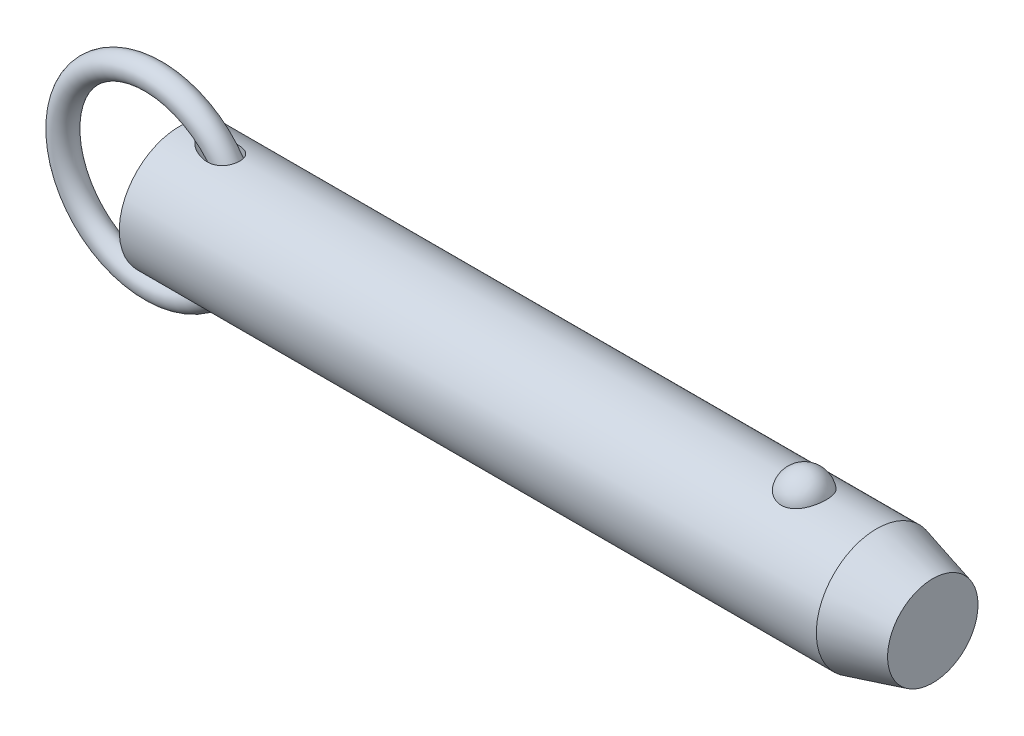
ISO-10303-21;
HEADER;
FILE_DESCRIPTION(('STEP AP214'),'2;1');
FILE_NAME('part.step','',(''),(''),'','','');
FILE_SCHEMA(('AUTOMOTIVE_DESIGN { 1 0 10303 214 1 1 1 1 }'));
ENDSEC;
DATA;
#1=APPLICATION_CONTEXT('core data for automotive mechanical design processes');
#2=APPLICATION_PROTOCOL_DEFINITION('international standard','automotive_design',2000,#1);
#3=PRODUCT_CONTEXT('',#1,'mechanical');
#4=PRODUCT('Part','Part','',(#3));
#5=PRODUCT_RELATED_PRODUCT_CATEGORY('part','',(#4));
#6=PRODUCT_DEFINITION_FORMATION('','',#4);
#7=PRODUCT_DEFINITION_CONTEXT('part definition',#1,'design');
#8=PRODUCT_DEFINITION('design','',#6,#7);
#9=PRODUCT_DEFINITION_SHAPE('','',#8);
#10=(LENGTH_UNIT() NAMED_UNIT(*) SI_UNIT(.MILLI.,.METRE.));
#11=(NAMED_UNIT(*) PLANE_ANGLE_UNIT() SI_UNIT($,.RADIAN.));
#12=(NAMED_UNIT(*) SI_UNIT($,.STERADIAN.) SOLID_ANGLE_UNIT());
#13=UNCERTAINTY_MEASURE_WITH_UNIT(LENGTH_MEASURE(1.E-05),#10,'distance_accuracy_value','');
#14=(GEOMETRIC_REPRESENTATION_CONTEXT(3) GLOBAL_UNCERTAINTY_ASSIGNED_CONTEXT((#13)) GLOBAL_UNIT_ASSIGNED_CONTEXT((#10,
#11,#12)) REPRESENTATION_CONTEXT('',''));
#15=CARTESIAN_POINT('',(0.,0.,0.));
#16=DIRECTION('',(0.,0.,1.));
#17=DIRECTION('',(1.,0.,0.));
#18=AXIS2_PLACEMENT_3D('',#15,#16,#17);
#19=CARTESIAN_POINT('',(-5.53898640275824,0.,0.));
#20=DIRECTION('',(0.,0.,1.));
#21=DIRECTION('',(1.,0.,0.));
#22=AXIS2_PLACEMENT_3D('',#19,#20,#21);
#23=TOROIDAL_SURFACE('',#22,19.05,2.54);
#24=CARTESIAN_POINT('',(16.0510135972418,0.,0.));
#25=VERTEX_POINT('',#24);
#26=VERTEX_LOOP('',#25);
#27=FACE_BOUND('',#26,.T.);
#28=ADVANCED_FACE('P0_F12',(#27),#23,.T.);
#29=CLOSED_SHELL('',(#28));
#30=MANIFOLD_SOLID_BREP('P0_B1',#29);
#31=CARTESIAN_POINT('',(0.,0.,0.));
#32=DIRECTION('',(1.,0.,0.));
#33=DIRECTION('',(0.,0.,-1.));
#34=AXIS2_PLACEMENT_3D('',#31,#32,#33);
#35=CYLINDRICAL_SURFACE('',#34,12.7);
#36=CARTESIAN_POINT('',(146.900738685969,0.,0.));
#37=DIRECTION('',(1.,0.,0.));
#38=DIRECTION('',(0.,0.,-1.));
#39=AXIS2_PLACEMENT_3D('',#36,#37,#38);
#40=CIRCLE('',#39,12.7);
#41=CARTESIAN_POINT('',(146.900738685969,0.,-12.7));
#42=VERTEX_POINT('',#41);
#43=EDGE_CURVE('P1_E89',#42,#42,#40,.T.);
#44=ORIENTED_EDGE('',*,*,#43,.F.);
#45=EDGE_LOOP('',(#44));
#46=FACE_BOUND('',#45,.T.);
#47=CARTESIAN_POINT('',(0.,0.,0.));
#48=DIRECTION('',(1.,0.,0.));
#49=DIRECTION('',(0.,0.,-1.));
#50=AXIS2_PLACEMENT_3D('',#47,#48,#49);
#51=CIRCLE('',#50,12.7);
#52=CARTESIAN_POINT('',(0.,0.,-12.7));
#53=VERTEX_POINT('',#52);
#54=EDGE_CURVE('P1_E52',#53,#53,#51,.T.);
#55=ORIENTED_EDGE('',*,*,#54,.T.);
#56=EDGE_LOOP('',(#55));
#57=FACE_BOUND('',#56,.T.);
#58=CARTESIAN_POINT('',(131.660042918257,11.7500437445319,4.81938502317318));
#59=CARTESIAN_POINT('',(131.535088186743,11.7500430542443,4.81938571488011));
#60=CARTESIAN_POINT('',(131.410144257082,11.7520975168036,4.81438658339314));
#61=CARTESIAN_POINT('',(131.161142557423,11.760253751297,4.79442904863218));
#62=CARTESIAN_POINT('',(131.037085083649,11.7663568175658,4.77946746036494));
#63=CARTESIAN_POINT('',(130.790901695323,11.7824262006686,4.73971414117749));
#64=CARTESIAN_POINT('',(130.668774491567,11.7923898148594,4.71492928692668));
#65=CARTESIAN_POINT('',(130.427187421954,11.8158938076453,4.65571340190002));
#66=CARTESIAN_POINT('',(130.30772859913,11.8294355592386,4.6212786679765));
#67=CARTESIAN_POINT('',(130.072557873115,11.8596812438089,4.54309502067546));
#68=CARTESIAN_POINT('',(129.956839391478,11.8763792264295,4.49936361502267));
#69=CARTESIAN_POINT('',(129.729653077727,11.9124878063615,4.40287235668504));
#70=CARTESIAN_POINT('',(129.618186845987,11.9318994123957,4.35010914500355));
#71=CARTESIAN_POINT('',(129.291278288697,11.9934256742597,4.17881316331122));
#72=CARTESIAN_POINT('',(129.083127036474,12.038858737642,4.04720756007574));
#73=CARTESIAN_POINT('',(128.685850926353,12.1352173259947,3.748564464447));
#74=CARTESIAN_POINT('',(128.497443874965,12.1862630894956,3.58061821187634));
#75=CARTESIAN_POINT('',(128.150521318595,12.2875163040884,3.21600758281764));
#76=CARTESIAN_POINT('',(127.992011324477,12.3377235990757,3.0193379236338));
#77=CARTESIAN_POINT('',(127.70168878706,12.4344923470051,2.592916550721));
#78=CARTESIAN_POINT('',(127.571376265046,12.4807925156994,2.36208286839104));
#79=CARTESIAN_POINT('',(127.349407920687,12.5623454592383,1.88070399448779));
#80=CARTESIAN_POINT('',(127.257755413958,12.5975972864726,1.63015711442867));
#81=CARTESIAN_POINT('',(127.114046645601,12.6538414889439,1.1129886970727));
#82=CARTESIAN_POINT('',(127.062499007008,12.6746503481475,0.846205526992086));
#83=CARTESIAN_POINT('',(127.001977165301,12.699153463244,0.307085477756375));
#84=CARTESIAN_POINT('',(126.993001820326,12.7028481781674,0.0347487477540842));
#85=CARTESIAN_POINT('',(127.017731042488,12.6927785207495,-0.506073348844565));
#86=CARTESIAN_POINT('',(127.051189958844,12.6791146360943,-0.774571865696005));
#87=CARTESIAN_POINT('',(127.159687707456,12.635882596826,-1.30170246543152));
#88=CARTESIAN_POINT('',(127.23472729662,12.606314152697,-1.56033436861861));
#89=CARTESIAN_POINT('',(127.42500006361,12.5342328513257,-2.06083899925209));
#90=CARTESIAN_POINT('',(127.540287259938,12.4917026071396,-2.30268867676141));
#91=CARTESIAN_POINT('',(127.808704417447,12.3981123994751,-2.76259600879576));
#92=CARTESIAN_POINT('',(127.961837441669,12.3470517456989,-2.98065173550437));
#93=CARTESIAN_POINT('',(128.303507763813,12.2416045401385,-3.38786328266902));
#94=CARTESIAN_POINT('',(128.492201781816,12.1872040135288,-3.57688418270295));
#95=CARTESIAN_POINT('',(128.900239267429,12.0814086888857,-3.91941073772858));
#96=CARTESIAN_POINT('',(129.119580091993,12.0300136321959,-4.07291945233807));
#97=CARTESIAN_POINT('',(129.578375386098,11.9373542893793,-4.33691289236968));
#98=CARTESIAN_POINT('',(129.817304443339,11.8958982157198,-4.44824125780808));
#99=CARTESIAN_POINT('',(130.31243761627,11.8268116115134,-4.62881985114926));
#100=CARTESIAN_POINT('',(130.568635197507,11.7991758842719,-4.69808589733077));
#101=CARTESIAN_POINT('',(131.077164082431,11.7622209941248,-4.78983181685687));
#102=CARTESIAN_POINT('',(131.329041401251,11.7520502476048,-4.81449025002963));
#103=CARTESIAN_POINT('',(131.833573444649,11.7485796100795,-4.82295735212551));
#104=CARTESIAN_POINT('',(132.086228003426,11.7552763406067,-4.80677420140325));
#105=CARTESIAN_POINT('',(132.576834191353,11.7842584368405,-4.73525430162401));
#106=CARTESIAN_POINT('',(132.814998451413,11.8060486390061,-4.68116061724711));
#107=CARTESIAN_POINT('',(133.278489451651,11.8622750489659,-4.53678133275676));
#108=CARTESIAN_POINT('',(133.503815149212,11.8967122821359,-4.44649279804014));
#109=CARTESIAN_POINT('',(133.940801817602,11.9754603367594,-4.22987613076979));
#110=CARTESIAN_POINT('',(134.152057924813,12.0199699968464,-4.10280539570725));
#111=CARTESIAN_POINT('',(134.550601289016,12.1138028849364,-3.81685409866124));
#112=CARTESIAN_POINT('',(134.737883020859,12.163127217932,-3.65796622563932));
#113=CARTESIAN_POINT('',(135.093350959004,12.2642343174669,-3.30364864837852));
#114=CARTESIAN_POINT('',(135.260111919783,12.3160165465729,-3.10678783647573));
#115=CARTESIAN_POINT('',(135.559579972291,12.4142566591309,-2.68748409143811));
#116=CARTESIAN_POINT('',(135.692280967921,12.4607135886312,-2.4650365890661));
#117=CARTESIAN_POINT('',(135.924691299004,12.5450236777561,-1.9928951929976));
#118=CARTESIAN_POINT('',(136.023215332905,12.5825557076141,-1.74255918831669));
#119=CARTESIAN_POINT('',(136.179227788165,12.6431720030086,-1.22773734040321));
#120=CARTESIAN_POINT('',(136.236715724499,12.6662560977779,-0.963251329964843));
#121=CARTESIAN_POINT('',(136.309544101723,12.6956486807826,-0.427355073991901));
#122=CARTESIAN_POINT('',(136.324837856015,12.7019385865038,-0.155937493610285));
#123=CARTESIAN_POINT('',(136.312779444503,12.6970201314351,0.385928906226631));
#124=CARTESIAN_POINT('',(136.28542805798,12.6858120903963,0.656377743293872));
#125=CARTESIAN_POINT('',(136.213060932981,12.6568455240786,1.05454017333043));
#126=CARTESIAN_POINT('',(136.183796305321,12.6451962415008,1.18577850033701));
#127=CARTESIAN_POINT('',(136.115022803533,12.6181819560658,1.44513808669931));
#128=CARTESIAN_POINT('',(136.075517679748,12.6028183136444,1.57326046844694));
#129=CARTESIAN_POINT('',(135.986439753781,12.5687547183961,1.82554978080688));
#130=CARTESIAN_POINT('',(135.936862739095,12.5500533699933,1.94971503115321));
#131=CARTESIAN_POINT('',(135.82792115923,12.5098093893,2.19314370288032));
#132=CARTESIAN_POINT('',(135.768560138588,12.4882677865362,2.31240887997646));
#133=CARTESIAN_POINT('',(135.63997128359,12.4427679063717,2.5459303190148));
#134=CARTESIAN_POINT('',(135.570688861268,12.4187964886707,2.66015396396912));
#135=CARTESIAN_POINT('',(135.422903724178,12.3691892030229,2.88202659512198));
#136=CARTESIAN_POINT('',(135.344404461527,12.3435539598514,2.98967802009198));
#137=CARTESIAN_POINT('',(135.178550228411,12.2912955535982,3.1977438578));
#138=CARTESIAN_POINT('',(135.091191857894,12.2646720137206,3.298155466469));
#139=CARTESIAN_POINT('',(134.908161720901,12.2111945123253,3.49095035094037));
#140=CARTESIAN_POINT('',(134.812493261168,12.1843406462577,3.58333679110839));
#141=CARTESIAN_POINT('',(134.613627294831,12.1312249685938,3.7592287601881));
#142=CARTESIAN_POINT('',(134.510450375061,12.104961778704,3.84275713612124));
#143=CARTESIAN_POINT('',(134.29701336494,12.0537284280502,4.00056406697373));
#144=CARTESIAN_POINT('',(134.186756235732,12.028757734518,4.07484645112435));
#145=CARTESIAN_POINT('',(133.959755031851,11.9808306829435,4.21367959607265));
#146=CARTESIAN_POINT('',(133.843006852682,11.9578756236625,4.27822410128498));
#147=CARTESIAN_POINT('',(133.60394258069,11.9147184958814,4.39698483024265));
#148=CARTESIAN_POINT('',(133.481628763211,11.894515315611,4.45120522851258));
#149=CARTESIAN_POINT('',(133.222952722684,11.8561129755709,4.55255353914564));
#150=CARTESIAN_POINT('',(133.086223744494,11.8381764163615,4.59884858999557));
#151=CARTESIAN_POINT('',(132.808608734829,11.8069093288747,4.67853897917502));
#152=CARTESIAN_POINT('',(132.667724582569,11.7935767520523,4.71194005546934));
#153=CARTESIAN_POINT('',(132.38309446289,11.7720277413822,4.76552188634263));
#154=CARTESIAN_POINT('',(132.239348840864,11.7638106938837,4.78570422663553));
#155=CARTESIAN_POINT('',(131.950411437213,11.7528195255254,4.81263433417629));
#156=CARTESIAN_POINT('',(131.805219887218,11.7500445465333,4.81938421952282));
#157=CARTESIAN_POINT('',(131.660042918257,11.7500437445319,4.81938502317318));
#158=B_SPLINE_CURVE_WITH_KNOTS('',3,(#58,#59,#60,#61,#62,#63,#64,#65,#66,#67,#68,#69,#70,#71,
#72,#73,#74,#75,#76,#77,#78,#79,#80,#81,#82,#83,#84,#85,#86,#87,#88,#89,#90,#91,#92,#93,#94,#95,
#96,#97,#98,#99,#100,#101,#102,#103,#104,#105,#106,#107,#108,#109,#110,#111,#112,#113,#114,#115,
#116,#117,#118,#119,#120,#121,#122,#123,#124,#125,#126,#127,#128,#129,#130,#131,#132,#133,#134,
#135,#136,#137,#138,#139,#140,#141,#142,#143,#144,#145,#146,#147,#148,#149,#150,#151,#152,#153,
#154,#155,#156,#157),.UNSPECIFIED.,.T.,.F.,(4,2,2,2,2,2,2,2,2,2,2,2,2,2,2,2,2,2,2,2,2,2,2,2,2,2,
2,2,2,2,2,2,2,2,2,2,2,2,2,2,2,2,2,2,2,2,2,2,2,4),(0.,0.374729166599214,0.749578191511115,
1.12416526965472,1.49889629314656,1.87292776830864,2.24709865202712,2.99481328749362,
3.76399449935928,4.53331735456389,5.3368391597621,6.14042986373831,6.95405296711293,
7.76765424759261,8.57656703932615,9.38549455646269,10.1955119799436,11.0055949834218,
11.8193353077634,12.6330054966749,13.4294141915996,14.2255231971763,14.9815786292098,
15.7374826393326,16.4696948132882,17.2019663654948,17.9501979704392,18.6986017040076,
19.4844704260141,20.2704797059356,21.0815215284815,21.8925729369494,22.7045213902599,
23.5164550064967,23.9209608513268,24.3253187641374,24.7298461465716,25.1342272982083,
25.54092555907,25.9474719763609,26.3541750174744,26.7607169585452,27.1661834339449,
27.5714814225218,27.9770386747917,28.3824315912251,28.8181206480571,29.2536155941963,
29.6890582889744,30.1244323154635),.UNSPECIFIED.);
#159=CARTESIAN_POINT('',(131.660042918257,11.7500437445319,4.81938502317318));
#160=VERTEX_POINT('',#159);
#161=EDGE_CURVE('P1_E80',#160,#160,#158,.T.);
#162=ORIENTED_EDGE('',*,*,#161,.T.);
#163=EDGE_LOOP('',(#162));
#164=FACE_BOUND('',#163,.T.);
#165=CARTESIAN_POINT('',(-5.53898640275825,0.,0.));
#166=DIRECTION('',(0.796400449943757,-0.604769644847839,0.));
#167=DIRECTION('',(0.604769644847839,0.796400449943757,0.));
#168=AXIS2_PLACEMENT_3D('',#165,#166,#167);
#169=ELLIPSE('',#168,15.9467514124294,12.7);
#170=CARTESIAN_POINT('',(4.0948214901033,12.6864319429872,0.586893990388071));
#171=VERTEX_POINT('',#170);
#172=CARTESIAN_POINT('',(4.0948214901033,12.6864319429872,-0.586893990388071));
#173=VERTEX_POINT('',#172);
#174=EDGE_CURVE('P1_E47',#171,#173,#169,.F.);
#175=ORIENTED_EDGE('',*,*,#174,.T.);
#176=CARTESIAN_POINT('',(4.06153170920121,12.6905758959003,-0.48916605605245));
#177=CARTESIAN_POINT('',(4.08111374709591,12.6881366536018,-0.552489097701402));
#178=CARTESIAN_POINT('',(4.10417851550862,12.6852663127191,-0.614604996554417));
#179=CARTESIAN_POINT('',(4.15628434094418,12.6787965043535,-0.736067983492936));
#180=CARTESIAN_POINT('',(4.18531032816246,12.6751988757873,-0.795421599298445));
#181=CARTESIAN_POINT('',(4.27911159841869,12.6636052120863,-0.967590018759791));
#182=CARTESIAN_POINT('',(4.35123408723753,12.654730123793,-1.07635920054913));
#183=CARTESIAN_POINT('',(4.49106800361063,12.6376715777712,-1.25922957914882));
#184=CARTESIAN_POINT('',(4.55601066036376,12.6297947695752,-1.33556751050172));
#185=CARTESIAN_POINT('',(4.69223626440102,12.6134116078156,-1.4823274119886));
#186=CARTESIAN_POINT('',(4.76352147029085,12.6049050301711,-1.55274725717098));
#187=CARTESIAN_POINT('',(4.91163946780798,12.587417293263,-1.68868704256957));
#188=CARTESIAN_POINT('',(4.98851399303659,12.5784327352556,-1.75416062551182));
#189=CARTESIAN_POINT('',(5.14630057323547,12.560235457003,-1.88003275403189));
#190=CARTESIAN_POINT('',(5.2272139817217,12.5510226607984,-1.94042957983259));
#191=CARTESIAN_POINT('',(5.45368877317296,12.5256514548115,-2.09966332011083));
#192=CARTESIAN_POINT('',(5.60261616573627,12.5094182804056,-2.19371988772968));
#193=CARTESIAN_POINT('',(5.90795545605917,12.4774211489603,-2.36893890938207));
#194=CARTESIAN_POINT('',(6.06437232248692,12.4616575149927,-2.45009264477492));
#195=CARTESIAN_POINT('',(6.38306132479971,12.431227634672,-2.60008249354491));
#196=CARTESIAN_POINT('',(6.54533237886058,12.4165611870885,-2.6689208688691));
#197=CARTESIAN_POINT('',(6.87462618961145,12.3889351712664,-2.79435199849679));
#198=CARTESIAN_POINT('',(7.04164773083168,12.3759751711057,-2.85094785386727));
#199=CARTESIAN_POINT('',(7.38726647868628,12.3518460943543,-2.95377962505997));
#200=CARTESIAN_POINT('',(7.56604577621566,12.3407843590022,-2.99943209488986));
#201=CARTESIAN_POINT('',(7.92698692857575,12.3219309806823,-3.07596683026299));
#202=CARTESIAN_POINT('',(8.10914972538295,12.314140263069,-3.10684491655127));
#203=CARTESIAN_POINT('',(8.47511457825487,12.3025918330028,-3.15226850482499));
#204=CARTESIAN_POINT('',(8.65890979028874,12.2988216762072,-3.16686440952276));
#205=CARTESIAN_POINT('',(9.02696087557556,12.2959421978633,-3.17802250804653));
#206=CARTESIAN_POINT('',(9.2112162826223,12.2968292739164,-3.17459864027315));
#207=CARTESIAN_POINT('',(9.61636263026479,12.3045198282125,-3.14471110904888));
#208=CARTESIAN_POINT('',(9.8369555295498,12.3125080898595,-3.11363232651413));
#209=CARTESIAN_POINT('',(10.1619126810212,12.3303028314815,-3.04206574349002));
#210=CARTESIAN_POINT('',(10.2692747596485,12.3372061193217,-3.01403983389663));
#211=CARTESIAN_POINT('',(10.4811758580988,12.3528538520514,-2.94925947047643));
#212=CARTESIAN_POINT('',(10.5857162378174,12.361597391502,-2.91250930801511));
#213=CARTESIAN_POINT('',(10.792132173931,12.3808585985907,-2.82951748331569));
#214=CARTESIAN_POINT('',(10.8939665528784,12.3913944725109,-2.78317723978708));
#215=CARTESIAN_POINT('',(11.092611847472,12.4138762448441,-2.68112002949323));
#216=CARTESIAN_POINT('',(11.1894254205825,12.4258213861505,-2.62540809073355));
#217=CARTESIAN_POINT('',(11.3768740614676,12.4507225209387,-2.50465655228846));
#218=CARTESIAN_POINT('',(11.4675115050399,12.4636781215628,-2.43962056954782));
#219=CARTESIAN_POINT('',(11.6414572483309,12.4901070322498,-2.30048560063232));
#220=CARTESIAN_POINT('',(11.7247669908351,12.5035802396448,-2.22638840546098));
#221=CARTESIAN_POINT('',(11.8713131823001,12.5285000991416,-2.08117367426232));
#222=CARTESIAN_POINT('',(11.9357009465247,12.5399538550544,-2.01121596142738));
#223=CARTESIAN_POINT('',(12.0576805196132,12.5624496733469,-1.86555293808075));
#224=CARTESIAN_POINT('',(12.1152732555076,12.5734917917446,-1.78984841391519));
#225=CARTESIAN_POINT('',(12.223073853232,12.5947858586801,-1.63327883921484));
#226=CARTESIAN_POINT('',(12.2732844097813,12.6050380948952,-1.55241568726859));
#227=CARTESIAN_POINT('',(12.3658430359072,12.6243983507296,-1.38621267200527));
#228=CARTESIAN_POINT('',(12.4081916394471,12.6335064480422,-1.30087311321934));
#229=CARTESIAN_POINT('',(12.5150098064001,12.6569076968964,-1.05702619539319));
#230=CARTESIAN_POINT('',(12.5703399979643,12.6695746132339,-0.894232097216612));
#231=CARTESIAN_POINT('',(12.6526225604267,12.6886816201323,-0.561391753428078));
#232=CARTESIAN_POINT('',(12.6795825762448,12.6951233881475,-0.391347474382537));
#233=CARTESIAN_POINT('',(12.7041016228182,12.7009766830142,-0.0537636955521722));
#234=CARTESIAN_POINT('',(12.7024538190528,12.7005778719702,0.113714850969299));
#235=CARTESIAN_POINT('',(12.6717240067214,12.6932548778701,0.445979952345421));
#236=CARTESIAN_POINT('',(12.6426435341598,12.6863310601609,0.610766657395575));
#237=CARTESIAN_POINT('',(12.5579769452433,12.6667465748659,0.932429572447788));
#238=CARTESIAN_POINT('',(12.5024793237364,12.6541050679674,1.08933027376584));
#239=CARTESIAN_POINT('',(12.3665691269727,12.6244558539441,1.39146752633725));
#240=CARTESIAN_POINT('',(12.2861577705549,12.6074483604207,1.53670464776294));
#241=CARTESIAN_POINT('',(12.1018203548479,12.5706804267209,1.81319588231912));
#242=CARTESIAN_POINT('',(11.9976588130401,12.5508932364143,1.94428915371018));
#243=CARTESIAN_POINT('',(11.7695265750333,12.5107540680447,2.18776051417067));
#244=CARTESIAN_POINT('',(11.6455540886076,12.4904020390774,2.30013691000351));
#245=CARTESIAN_POINT('',(11.3759347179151,12.4502278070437,2.50870972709));
#246=CARTESIAN_POINT('',(11.2295880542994,12.4304654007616,2.60400962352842));
#247=CARTESIAN_POINT('',(10.9239803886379,12.3941696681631,2.77162929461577));
#248=CARTESIAN_POINT('',(10.7647152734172,12.3776373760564,2.84394171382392));
#249=CARTESIAN_POINT('',(10.4192039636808,12.3473062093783,2.97303525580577));
#250=CARTESIAN_POINT('',(10.2319332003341,12.3340204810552,3.027171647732));
#251=CARTESIAN_POINT('',(9.85152982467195,12.3134301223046,3.10986173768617));
#252=CARTESIAN_POINT('',(9.65839336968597,12.3061295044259,3.13839827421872));
#253=CARTESIAN_POINT('',(9.31022514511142,12.2982822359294,3.16897517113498));
#254=CARTESIAN_POINT('',(9.15555718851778,12.2966525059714,3.17526894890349));
#255=CARTESIAN_POINT('',(8.8461894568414,12.2967963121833,3.17471335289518));
#256=CARTESIAN_POINT('',(8.69148970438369,12.2985715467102,3.16785742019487));
#257=CARTESIAN_POINT('',(8.38280471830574,12.3051648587,3.14214692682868));
#258=CARTESIAN_POINT('',(8.22882218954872,12.3099904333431,3.12326280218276));
#259=CARTESIAN_POINT('',(7.92276070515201,12.3222644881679,3.07448013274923));
#260=CARTESIAN_POINT('',(7.77068148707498,12.3297126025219,3.04458312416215));
#261=CARTESIAN_POINT('',(7.46452663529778,12.3470493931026,2.97350781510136));
#262=CARTESIAN_POINT('',(7.31052714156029,12.3570043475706,2.93201910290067));
#263=CARTESIAN_POINT('',(7.00579083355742,12.3787609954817,2.83876185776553));
#264=CARTESIAN_POINT('',(6.85505451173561,12.3905629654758,2.7869917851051));
#265=CARTESIAN_POINT('',(6.55781208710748,12.415528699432,2.67357744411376));
#266=CARTESIAN_POINT('',(6.41129783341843,12.4286895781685,2.61195394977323));
#267=CARTESIAN_POINT('',(6.12302950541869,12.4559398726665,2.47874512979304));
#268=CARTESIAN_POINT('',(5.98127390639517,12.4700289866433,2.40716303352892));
#269=CARTESIAN_POINT('',(5.67073126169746,12.5020754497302,2.2355042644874));
#270=CARTESIAN_POINT('',(5.50343839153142,12.5201625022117,2.13268685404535));
#271=CARTESIAN_POINT('',(5.26147616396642,12.5471537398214,1.96522579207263));
#272=CARTESIAN_POINT('',(5.18224299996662,12.5561365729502,1.90713440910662));
#273=CARTESIAN_POINT('',(5.0274647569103,12.573912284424,1.78618989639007));
#274=CARTESIAN_POINT('',(4.95191912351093,12.5827051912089,1.72333748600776));
#275=CARTESIAN_POINT('',(4.81787163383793,12.598469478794,1.60360864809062));
#276=CARTESIAN_POINT('',(4.75865966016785,12.6054958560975,1.54753994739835));
#277=CARTESIAN_POINT('',(4.64406285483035,12.6191906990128,1.43158546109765));
#278=CARTESIAN_POINT('',(4.58867926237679,12.6258590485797,1.37169845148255));
#279=CARTESIAN_POINT('',(4.43014912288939,12.6450546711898,1.18656670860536));
#280=CARTESIAN_POINT('',(4.33372726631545,12.6568788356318,1.05507993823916));
#281=CARTESIAN_POINT('',(4.21252055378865,12.6718304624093,0.848052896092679));
#282=CARTESIAN_POINT('',(4.17660155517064,12.6762773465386,0.779100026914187));
#283=CARTESIAN_POINT('',(4.11264979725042,12.6842122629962,0.63708048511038));
#284=CARTESIAN_POINT('',(4.08466792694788,12.6876941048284,0.56399071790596));
#285=CARTESIAN_POINT('',(4.0615317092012,12.6905758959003,0.489166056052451));
#286=B_SPLINE_CURVE_WITH_KNOTS('',3,(#176,#177,#178,#179,#180,#181,#182,#183,#184,#185,#186,
#187,#188,#189,#190,#191,#192,#193,#194,#195,#196,#197,#198,#199,#200,#201,#202,#203,#204,#205,
#206,#207,#208,#209,#210,#211,#212,#213,#214,#215,#216,#217,#218,#219,#220,#221,#222,#223,#224,
#225,#226,#227,#228,#229,#230,#231,#232,#233,#234,#235,#236,#237,#238,#239,#240,#241,#242,#243,
#244,#245,#246,#247,#248,#249,#250,#251,#252,#253,#254,#255,#256,#257,#258,#259,#260,#261,#262,
#263,#264,#265,#266,#267,#268,#269,#270,#271,#272,#273,#274,#275,#276,#277,#278,#279,#280,#281,
#282,#283,#284,#285),.UNSPECIFIED.,.F.,.F.,(4,2,2,2,2,2,2,2,2,2,2,2,2,2,2,2,2,2,2,2,2,2,2,2,2,2,
2,2,2,2,2,2,2,2,2,2,2,2,2,2,2,2,2,2,2,2,2,2,2,2,2,2,2,2,4),(0.,0.198708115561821,
0.39691995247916,0.787580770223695,1.08882492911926,1.39017679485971,1.69407136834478,
1.9980684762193,2.52793143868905,3.05815092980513,3.58827293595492,4.11826050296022,
4.67218806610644,5.22627222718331,5.77863637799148,6.33057333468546,6.99657211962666,
7.3297741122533,7.66281254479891,7.99946156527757,8.33593054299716,8.67226935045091,
9.00854178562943,9.29544181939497,9.58230266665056,9.86905853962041,10.155794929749,
10.670233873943,11.184534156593,11.6845985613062,12.1846349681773,12.6830079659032,
13.1813565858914,13.6848795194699,14.1884479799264,14.713533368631,15.2387866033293,
15.8228373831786,16.4072794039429,16.8710810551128,17.3351141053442,17.8002921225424,
18.2654052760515,18.7444169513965,19.2235004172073,19.7015868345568,20.1795185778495,
20.7699825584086,21.0658110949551,21.361595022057,21.6069574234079,21.8523988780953,
22.3397467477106,22.5729183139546,22.8075527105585),.UNSPECIFIED.);
#287=EDGE_CURVE('P1_E51',#173,#171,#286,.T.);
#288=ORIENTED_EDGE('',*,*,#287,.T.);
#289=EDGE_LOOP('',(#175,#288));
#290=FACE_BOUND('',#289,.T.);
#291=CARTESIAN_POINT('',(-5.53898640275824,0.,0.));
#292=DIRECTION('',(-0.796400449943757,-0.604769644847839,0.));
#293=DIRECTION('',(0.604769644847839,-0.796400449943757,0.));
#294=AXIS2_PLACEMENT_3D('',#291,#292,#293);
#295=ELLIPSE('',#294,15.9467514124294,12.7);
#296=CARTESIAN_POINT('',(4.09482149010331,-12.6864319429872,0.586893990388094));
#297=VERTEX_POINT('',#296);
#298=CARTESIAN_POINT('',(4.09482149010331,-12.6864319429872,-0.586893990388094));
#299=VERTEX_POINT('',#298);
#300=EDGE_CURVE('P1_E28',#297,#299,#295,.F.);
#301=ORIENTED_EDGE('',*,*,#300,.F.);
#302=CARTESIAN_POINT('',(4.06153170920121,-12.6905758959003,0.489166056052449));
#303=CARTESIAN_POINT('',(4.08111374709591,-12.6881366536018,0.552489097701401));
#304=CARTESIAN_POINT('',(4.10417851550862,-12.6852663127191,0.614604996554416));
#305=CARTESIAN_POINT('',(4.15628434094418,-12.6787965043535,0.736067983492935));
#306=CARTESIAN_POINT('',(4.18531032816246,-12.6751988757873,0.795421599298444));
#307=CARTESIAN_POINT('',(4.27911159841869,-12.6636052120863,0.967590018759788));
#308=CARTESIAN_POINT('',(4.35123408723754,-12.654730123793,1.07635920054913));
#309=CARTESIAN_POINT('',(4.49106800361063,-12.6376715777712,1.25922957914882));
#310=CARTESIAN_POINT('',(4.55601066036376,-12.6297947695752,1.33556751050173));
#311=CARTESIAN_POINT('',(4.69223626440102,-12.6134116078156,1.4823274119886));
#312=CARTESIAN_POINT('',(4.76352147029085,-12.6049050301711,1.55274725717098));
#313=CARTESIAN_POINT('',(4.91163946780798,-12.587417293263,1.68868704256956));
#314=CARTESIAN_POINT('',(4.98851399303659,-12.5784327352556,1.75416062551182));
#315=CARTESIAN_POINT('',(5.14630057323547,-12.560235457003,1.88003275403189));
#316=CARTESIAN_POINT('',(5.2272139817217,-12.5510226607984,1.94042957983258));
#317=CARTESIAN_POINT('',(5.45368877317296,-12.5256514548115,2.09966332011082));
#318=CARTESIAN_POINT('',(5.60261616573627,-12.5094182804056,2.19371988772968));
#319=CARTESIAN_POINT('',(5.90795545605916,-12.4774211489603,2.36893890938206));
#320=CARTESIAN_POINT('',(6.06437232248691,-12.4616575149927,2.45009264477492));
#321=CARTESIAN_POINT('',(6.3830613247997,-12.431227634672,2.6000824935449));
#322=CARTESIAN_POINT('',(6.54533237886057,-12.4165611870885,2.66892086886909));
#323=CARTESIAN_POINT('',(6.87462618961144,-12.3889351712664,2.79435199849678));
#324=CARTESIAN_POINT('',(7.04164773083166,-12.3759751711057,2.85094785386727));
#325=CARTESIAN_POINT('',(7.38726647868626,-12.3518460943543,2.95377962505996));
#326=CARTESIAN_POINT('',(7.56604577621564,-12.3407843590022,2.99943209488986));
#327=CARTESIAN_POINT('',(7.92698692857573,-12.3219309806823,3.07596683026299));
#328=CARTESIAN_POINT('',(8.10914972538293,-12.314140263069,3.10684491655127));
#329=CARTESIAN_POINT('',(8.47511457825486,-12.3025918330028,3.15226850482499));
#330=CARTESIAN_POINT('',(8.65890979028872,-12.2988216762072,3.16686440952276));
#331=CARTESIAN_POINT('',(9.02696087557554,-12.2959421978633,3.17802250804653));
#332=CARTESIAN_POINT('',(9.21121628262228,-12.2968292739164,3.17459864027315));
#333=CARTESIAN_POINT('',(9.61636263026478,-12.3045198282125,3.14471110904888));
#334=CARTESIAN_POINT('',(9.83695552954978,-12.3125080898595,3.11363232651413));
#335=CARTESIAN_POINT('',(10.1619126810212,-12.3303028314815,3.04206574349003));
#336=CARTESIAN_POINT('',(10.2692747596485,-12.3372061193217,3.01403983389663));
#337=CARTESIAN_POINT('',(10.4811758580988,-12.3528538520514,2.94925947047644));
#338=CARTESIAN_POINT('',(10.5857162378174,-12.361597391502,2.91250930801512));
#339=CARTESIAN_POINT('',(10.792132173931,-12.3808585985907,2.8295174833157));
#340=CARTESIAN_POINT('',(10.8939665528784,-12.3913944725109,2.78317723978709));
#341=CARTESIAN_POINT('',(11.092611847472,-12.4138762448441,2.68112002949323));
#342=CARTESIAN_POINT('',(11.1894254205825,-12.4258213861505,2.62540809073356));
#343=CARTESIAN_POINT('',(11.3768740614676,-12.4507225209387,2.50465655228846));
#344=CARTESIAN_POINT('',(11.4675115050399,-12.4636781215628,2.43962056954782));
#345=CARTESIAN_POINT('',(11.6414572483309,-12.4901070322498,2.30048560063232));
#346=CARTESIAN_POINT('',(11.7247669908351,-12.5035802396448,2.22638840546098));
#347=CARTESIAN_POINT('',(11.8713131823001,-12.5285000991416,2.08117367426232));
#348=CARTESIAN_POINT('',(11.9357009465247,-12.5399538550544,2.01121596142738));
#349=CARTESIAN_POINT('',(12.0576805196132,-12.5624496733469,1.86555293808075));
#350=CARTESIAN_POINT('',(12.1152732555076,-12.5734917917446,1.78984841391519));
#351=CARTESIAN_POINT('',(12.223073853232,-12.5947858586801,1.63327883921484));
#352=CARTESIAN_POINT('',(12.2732844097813,-12.6050380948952,1.55241568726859));
#353=CARTESIAN_POINT('',(12.3658430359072,-12.6243983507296,1.38621267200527));
#354=CARTESIAN_POINT('',(12.4081916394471,-12.6335064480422,1.30087311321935));
#355=CARTESIAN_POINT('',(12.5150098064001,-12.6569076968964,1.05702619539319));
#356=CARTESIAN_POINT('',(12.5703399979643,-12.6695746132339,0.894232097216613));
#357=CARTESIAN_POINT('',(12.6526225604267,-12.6886816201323,0.561391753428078));
#358=CARTESIAN_POINT('',(12.6795825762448,-12.6951233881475,0.391347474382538));
#359=CARTESIAN_POINT('',(12.7041016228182,-12.7009766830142,0.0537636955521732));
#360=CARTESIAN_POINT('',(12.7024538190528,-12.7005778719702,-0.113714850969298));
#361=CARTESIAN_POINT('',(12.6717240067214,-12.6932548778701,-0.44597995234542));
#362=CARTESIAN_POINT('',(12.6426435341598,-12.6863310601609,-0.610766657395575));
#363=CARTESIAN_POINT('',(12.5579769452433,-12.6667465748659,-0.932429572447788));
#364=CARTESIAN_POINT('',(12.5024793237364,-12.6541050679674,-1.08933027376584));
#365=CARTESIAN_POINT('',(12.3665691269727,-12.6244558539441,-1.39146752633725));
#366=CARTESIAN_POINT('',(12.2861577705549,-12.6074483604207,-1.53670464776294));
#367=CARTESIAN_POINT('',(12.1018203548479,-12.5706804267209,-1.81319588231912));
#368=CARTESIAN_POINT('',(11.9976588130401,-12.5508932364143,-1.94428915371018));
#369=CARTESIAN_POINT('',(11.7695265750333,-12.5107540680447,-2.18776051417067));
#370=CARTESIAN_POINT('',(11.6455540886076,-12.4904020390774,-2.30013691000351));
#371=CARTESIAN_POINT('',(11.3759347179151,-12.4502278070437,-2.50870972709));
#372=CARTESIAN_POINT('',(11.2295880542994,-12.4304654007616,-2.60400962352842));
#373=CARTESIAN_POINT('',(10.9239803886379,-12.3941696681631,-2.77162929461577));
#374=CARTESIAN_POINT('',(10.7647152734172,-12.3776373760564,-2.84394171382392));
#375=CARTESIAN_POINT('',(10.4192039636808,-12.3473062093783,-2.97303525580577));
#376=CARTESIAN_POINT('',(10.2319332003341,-12.3340204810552,-3.027171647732));
#377=CARTESIAN_POINT('',(9.85152982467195,-12.3134301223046,-3.10986173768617));
#378=CARTESIAN_POINT('',(9.65839336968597,-12.3061295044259,-3.13839827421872));
#379=CARTESIAN_POINT('',(9.31022514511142,-12.2982822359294,-3.16897517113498));
#380=CARTESIAN_POINT('',(9.15555718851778,-12.2966525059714,-3.17526894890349));
#381=CARTESIAN_POINT('',(8.8461894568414,-12.2967963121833,-3.17471335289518));
#382=CARTESIAN_POINT('',(8.69148970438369,-12.2985715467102,-3.16785742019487));
#383=CARTESIAN_POINT('',(8.38280471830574,-12.3051648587,-3.14214692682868));
#384=CARTESIAN_POINT('',(8.22882218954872,-12.3099904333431,-3.12326280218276));
#385=CARTESIAN_POINT('',(7.92276070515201,-12.3222644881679,-3.07448013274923));
#386=CARTESIAN_POINT('',(7.77068148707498,-12.3297126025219,-3.04458312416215));
#387=CARTESIAN_POINT('',(7.46452663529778,-12.3470493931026,-2.97350781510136));
#388=CARTESIAN_POINT('',(7.31052714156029,-12.3570043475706,-2.93201910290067));
#389=CARTESIAN_POINT('',(7.00579083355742,-12.3787609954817,-2.83876185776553));
#390=CARTESIAN_POINT('',(6.85505451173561,-12.3905629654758,-2.7869917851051));
#391=CARTESIAN_POINT('',(6.55781208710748,-12.415528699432,-2.67357744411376));
#392=CARTESIAN_POINT('',(6.41129783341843,-12.4286895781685,-2.61195394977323));
#393=CARTESIAN_POINT('',(6.12302950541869,-12.4559398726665,-2.47874512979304));
#394=CARTESIAN_POINT('',(5.98127390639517,-12.4700289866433,-2.40716303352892));
#395=CARTESIAN_POINT('',(5.67073126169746,-12.5020754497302,-2.2355042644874));
#396=CARTESIAN_POINT('',(5.50343839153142,-12.5201625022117,-2.13268685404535));
#397=CARTESIAN_POINT('',(5.26147616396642,-12.5471537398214,-1.96522579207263));
#398=CARTESIAN_POINT('',(5.18224299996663,-12.5561365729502,-1.90713440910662));
#399=CARTESIAN_POINT('',(5.0274647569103,-12.573912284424,-1.78618989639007));
#400=CARTESIAN_POINT('',(4.95191912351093,-12.5827051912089,-1.72333748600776));
#401=CARTESIAN_POINT('',(4.81787163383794,-12.598469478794,-1.60360864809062));
#402=CARTESIAN_POINT('',(4.75865966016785,-12.6054958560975,-1.54753994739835));
#403=CARTESIAN_POINT('',(4.64406285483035,-12.6191906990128,-1.43158546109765));
#404=CARTESIAN_POINT('',(4.58867926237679,-12.6258590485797,-1.37169845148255));
#405=CARTESIAN_POINT('',(4.43014912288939,-12.6450546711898,-1.18656670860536));
#406=CARTESIAN_POINT('',(4.33372726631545,-12.6568788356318,-1.05507993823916));
#407=CARTESIAN_POINT('',(4.21252055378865,-12.6718304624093,-0.848052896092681));
#408=CARTESIAN_POINT('',(4.17660155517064,-12.6762773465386,-0.779100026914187));
#409=CARTESIAN_POINT('',(4.11264979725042,-12.6842122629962,-0.637080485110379));
#410=CARTESIAN_POINT('',(4.08466792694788,-12.6876941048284,-0.563990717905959));
#411=CARTESIAN_POINT('',(4.06153170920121,-12.6905758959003,-0.48916605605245));
#412=B_SPLINE_CURVE_WITH_KNOTS('',3,(#302,#303,#304,#305,#306,#307,#308,#309,#310,#311,#312,
#313,#314,#315,#316,#317,#318,#319,#320,#321,#322,#323,#324,#325,#326,#327,#328,#329,#330,#331,
#332,#333,#334,#335,#336,#337,#338,#339,#340,#341,#342,#343,#344,#345,#346,#347,#348,#349,#350,
#351,#352,#353,#354,#355,#356,#357,#358,#359,#360,#361,#362,#363,#364,#365,#366,#367,#368,#369,
#370,#371,#372,#373,#374,#375,#376,#377,#378,#379,#380,#381,#382,#383,#384,#385,#386,#387,#388,
#389,#390,#391,#392,#393,#394,#395,#396,#397,#398,#399,#400,#401,#402,#403,#404,#405,#406,#407,
#408,#409,#410,#411),.UNSPECIFIED.,.F.,.F.,(4,2,2,2,2,2,2,2,2,2,2,2,2,2,2,2,2,2,2,2,2,2,2,2,2,2,
2,2,2,2,2,2,2,2,2,2,2,2,2,2,2,2,2,2,2,2,2,2,2,2,2,2,2,2,4),(0.,0.198708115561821,
0.39691995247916,0.787580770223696,1.08882492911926,1.39017679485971,1.69407136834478,
1.9980684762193,2.52793143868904,3.05815092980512,3.58827293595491,4.11826050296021,
4.67218806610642,5.22627222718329,5.77863637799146,6.33057333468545,6.99657211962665,
7.32977411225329,7.6628125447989,7.99946156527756,8.33593054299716,8.67226935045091,
9.00854178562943,9.29544181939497,9.58230266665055,9.86905853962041,10.155794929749,
10.670233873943,11.184534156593,11.6845985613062,12.1846349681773,12.6830079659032,
13.1813565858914,13.6848795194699,14.1884479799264,14.713533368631,15.2387866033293,
15.8228373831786,16.4072794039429,16.8710810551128,17.3351141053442,17.8002921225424,
18.2654052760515,18.7444169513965,19.2235004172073,19.7015868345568,20.1795185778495,
20.7699825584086,21.0658110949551,21.361595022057,21.6069574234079,21.8523988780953,
22.3397467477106,22.5729183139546,22.8075527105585),.UNSPECIFIED.);
#413=EDGE_CURVE('P1_E10',#297,#299,#412,.T.);
#414=ORIENTED_EDGE('',*,*,#413,.T.);
#415=EDGE_LOOP('',(#301,#414));
#416=FACE_BOUND('',#415,.T.);
#417=ADVANCED_FACE('P1_F15',(#46,#57,#164,#290,#416),#35,.T.);
#418=CARTESIAN_POINT('',(0.,0.,0.));
#419=DIRECTION('',(-1.,0.,0.));
#420=DIRECTION('',(0.,0.,1.));
#421=AXIS2_PLACEMENT_3D('',#418,#419,#420);
#422=PLANE('',#421);
#423=ORIENTED_EDGE('',*,*,#54,.F.);
#424=EDGE_LOOP('',(#423));
#425=FACE_BOUND('',#424,.T.);
#426=ADVANCED_FACE('P1_F17',(#425),#422,.T.);
#427=CARTESIAN_POINT('',(158.75,0.,0.));
#428=DIRECTION('',(-1.,0.,0.));
#429=DIRECTION('',(0.,0.,1.));
#430=AXIS2_PLACEMENT_3D('',#427,#428,#429);
#431=CONICAL_SURFACE('',#430,9.52500000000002,0.26179938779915);
#432=ORIENTED_EDGE('',*,*,#43,.T.);
#433=EDGE_LOOP('',(#432));
#434=FACE_BOUND('',#433,.T.);
#435=CARTESIAN_POINT('',(158.75,0.,0.));
#436=DIRECTION('',(1.,0.,0.));
#437=DIRECTION('',(0.,0.,-1.));
#438=AXIS2_PLACEMENT_3D('',#435,#436,#437);
#439=CIRCLE('',#438,9.52500000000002);
#440=CARTESIAN_POINT('',(158.75,0.,-9.52500000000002));
#441=VERTEX_POINT('',#440);
#442=EDGE_CURVE('P1_E86',#441,#441,#439,.T.);
#443=ORIENTED_EDGE('',*,*,#442,.F.);
#444=EDGE_LOOP('',(#443));
#445=FACE_BOUND('',#444,.T.);
#446=ADVANCED_FACE('P1_F105',(#434,#445),#431,.T.);
#447=CARTESIAN_POINT('',(158.75,9.52500000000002,0.));
#448=DIRECTION('',(1.,0.,0.));
#449=DIRECTION('',(0.,0.,-1.));
#450=AXIS2_PLACEMENT_3D('',#447,#448,#449);
#451=PLANE('',#450);
#452=ORIENTED_EDGE('',*,*,#442,.T.);
#453=EDGE_LOOP('',(#452));
#454=FACE_BOUND('',#453,.T.);
#455=ADVANCED_FACE('P1_F78',(#454),#451,.T.);
#456=CARTESIAN_POINT('',(131.660042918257,11.43,0.));
#457=DIRECTION('',(-1.,0.,0.));
#458=DIRECTION('',(0.,1.,0.));
#459=AXIS2_PLACEMENT_3D('',#456,#457,#458);
#460=SPHERICAL_SURFACE('',#459,4.83);
#461=ORIENTED_EDGE('',*,*,#161,.F.);
#462=EDGE_LOOP('',(#461));
#463=FACE_BOUND('',#462,.T.);
#464=ADVANCED_FACE('P1_F71',(#463),#460,.T.);
#465=CARTESIAN_POINT('',(-5.53898640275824,0.,0.));
#466=DIRECTION('',(0.,0.,1.));
#467=DIRECTION('',(1.,0.,0.));
#468=AXIS2_PLACEMENT_3D('',#465,#466,#467);
#469=TOROIDAL_SURFACE('',#468,19.05,3.175);
#470=CARTESIAN_POINT('',(5.9818753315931,-15.1714285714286,0.));
#471=DIRECTION('',(-0.796400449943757,-0.604769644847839,0.));
#472=DIRECTION('',(0.604769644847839,-0.796400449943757,0.));
#473=AXIS2_PLACEMENT_3D('',#470,#471,#472);
#474=CIRCLE('',#473,3.175);
#475=EDGE_CURVE('P1_E34',#297,#299,#474,.T.);
#476=ORIENTED_EDGE('',*,*,#475,.T.);
#477=ORIENTED_EDGE('',*,*,#413,.F.);
#478=EDGE_LOOP('',(#476,#477));
#479=FACE_BOUND('',#478,.T.);
#480=CARTESIAN_POINT('',(5.9818753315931,15.1714285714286,0.));
#481=DIRECTION('',(0.796400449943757,-0.604769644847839,0.));
#482=DIRECTION('',(0.604769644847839,0.796400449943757,0.));
#483=AXIS2_PLACEMENT_3D('',#480,#481,#482);
#484=CIRCLE('',#483,3.175);
#485=EDGE_CURVE('P1_E41',#171,#173,#484,.T.);
#486=ORIENTED_EDGE('',*,*,#485,.F.);
#487=ORIENTED_EDGE('',*,*,#287,.F.);
#488=EDGE_LOOP('',(#486,#487));
#489=FACE_BOUND('',#488,.T.);
#490=ADVANCED_FACE('P1_F55',(#479,#489),#469,.F.);
#491=CARTESIAN_POINT('',(5.9818753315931,-15.1714285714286,0.));
#492=DIRECTION('',(-0.796400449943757,-0.604769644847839,0.));
#493=DIRECTION('',(0.604769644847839,-0.796400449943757,0.));
#494=AXIS2_PLACEMENT_3D('',#491,#492,#493);
#495=PLANE('',#494);
#496=ORIENTED_EDGE('',*,*,#300,.T.);
#497=ORIENTED_EDGE('',*,*,#475,.F.);
#498=EDGE_LOOP('',(#496,#497));
#499=FACE_BOUND('',#498,.T.);
#500=ADVANCED_FACE('P1_F70',(#499),#495,.F.);
#501=CARTESIAN_POINT('',(5.9818753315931,15.1714285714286,0.));
#502=DIRECTION('',(0.796400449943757,-0.604769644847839,0.));
#503=DIRECTION('',(0.604769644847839,0.796400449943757,0.));
#504=AXIS2_PLACEMENT_3D('',#501,#502,#503);
#505=PLANE('',#504);
#506=ORIENTED_EDGE('',*,*,#485,.T.);
#507=ORIENTED_EDGE('',*,*,#174,.F.);
#508=EDGE_LOOP('',(#506,#507));
#509=FACE_BOUND('',#508,.T.);
#510=ADVANCED_FACE('P1_F48',(#509),#505,.T.);
#511=CLOSED_SHELL('',(#417,#426,#446,#455,#464,#490,#500,#510));
#512=MANIFOLD_SOLID_BREP('P1_B1',#511);
#513=ADVANCED_BREP_SHAPE_REPRESENTATION('',(#18,#30,#512),#14);
#514=SHAPE_DEFINITION_REPRESENTATION(#9,#513);
ENDSEC;
END-ISO-10303-21;
